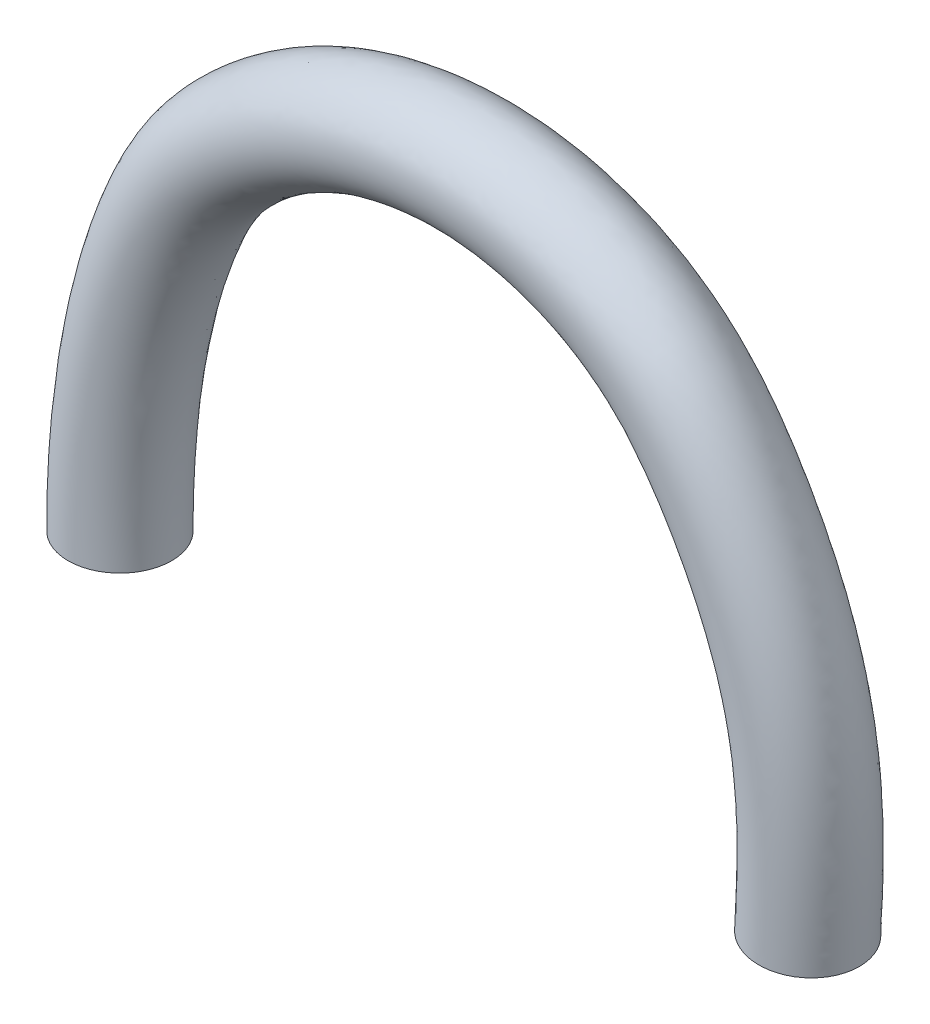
ISO-10303-21;
HEADER;
FILE_DESCRIPTION(('STEP AP214'),'2;1');
FILE_NAME('part.step','',(''),(''),'','','');
FILE_SCHEMA(('AUTOMOTIVE_DESIGN { 1 0 10303 214 1 1 1 1 }'));
ENDSEC;
DATA;
#1=APPLICATION_CONTEXT('core data for automotive mechanical design processes');
#2=APPLICATION_PROTOCOL_DEFINITION('international standard','automotive_design',2000,#1);
#3=PRODUCT_CONTEXT('',#1,'mechanical');
#4=PRODUCT('Part','Part','',(#3));
#5=PRODUCT_RELATED_PRODUCT_CATEGORY('part','',(#4));
#6=PRODUCT_DEFINITION_FORMATION('','',#4);
#7=PRODUCT_DEFINITION_CONTEXT('part definition',#1,'design');
#8=PRODUCT_DEFINITION('design','',#6,#7);
#9=PRODUCT_DEFINITION_SHAPE('','',#8);
#10=(LENGTH_UNIT() NAMED_UNIT(*) SI_UNIT(.MILLI.,.METRE.));
#11=(NAMED_UNIT(*) PLANE_ANGLE_UNIT() SI_UNIT($,.RADIAN.));
#12=(NAMED_UNIT(*) SI_UNIT($,.STERADIAN.) SOLID_ANGLE_UNIT());
#13=UNCERTAINTY_MEASURE_WITH_UNIT(LENGTH_MEASURE(1.E-05),#10,'distance_accuracy_value','');
#14=(GEOMETRIC_REPRESENTATION_CONTEXT(3) GLOBAL_UNCERTAINTY_ASSIGNED_CONTEXT((#13)) GLOBAL_UNIT_ASSIGNED_CONTEXT((#10,
#11,#12)) REPRESENTATION_CONTEXT('',''));
#15=CARTESIAN_POINT('',(0.,0.,0.));
#16=DIRECTION('',(0.,0.,1.));
#17=DIRECTION('',(1.,0.,0.));
#18=AXIS2_PLACEMENT_3D('',#15,#16,#17);
#19=CARTESIAN_POINT('',(0.,0.,0.));
#20=DIRECTION('',(0.,1.,0.));
#21=DIRECTION('',(0.,0.,1.));
#22=AXIS2_PLACEMENT_3D('',#19,#20,#21);
#23=PLANE('',#22);
#24=CARTESIAN_POINT('',(0.,0.,0.));
#25=DIRECTION('',(0.,-1.,0.));
#26=DIRECTION('',(0.,0.,-1.));
#27=AXIS2_PLACEMENT_3D('',#24,#25,#26);
#28=CIRCLE('',#27,19.1349262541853);
#29=CARTESIAN_POINT('',(0.,0.,-19.1349262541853));
#30=VERTEX_POINT('',#29);
#31=EDGE_CURVE('E17',#30,#30,#28,.F.);
#32=ORIENTED_EDGE('',*,*,#31,.F.);
#33=EDGE_LOOP('',(#32));
#34=FACE_BOUND('',#33,.T.);
#35=ADVANCED_FACE('F14',(#34),#23,.F.);
#36=CARTESIAN_POINT('',(0.,2.,0.));
#37=DIRECTION('',(0.,-1.,0.));
#38=DIRECTION('',(0.,0.,-1.));
#39=AXIS2_PLACEMENT_3D('',#36,#37,#38);
#40=CYLINDRICAL_SURFACE('',#39,19.1349262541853);
#41=CARTESIAN_POINT('',(0.,2.,0.));
#42=DIRECTION('',(0.,-1.,0.));
#43=DIRECTION('',(0.,0.,-1.));
#44=AXIS2_PLACEMENT_3D('',#41,#42,#43);
#45=CIRCLE('',#44,19.1349262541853);
#46=CARTESIAN_POINT('',(0.,2.,-19.1349262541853));
#47=VERTEX_POINT('',#46);
#48=EDGE_CURVE('E26',#47,#47,#45,.F.);
#49=ORIENTED_EDGE('',*,*,#48,.F.);
#50=EDGE_LOOP('',(#49));
#51=FACE_BOUND('',#50,.T.);
#52=ORIENTED_EDGE('',*,*,#31,.T.);
#53=EDGE_LOOP('',(#52));
#54=FACE_BOUND('',#53,.T.);
#55=ADVANCED_FACE('F46',(#51,#54),#40,.T.);
#56=CARTESIAN_POINT('',(0.,2.,0.));
#57=DIRECTION('',(0.,-1.,0.));
#58=DIRECTION('',(0.,0.,-1.));
#59=AXIS2_PLACEMENT_3D('',#56,#57,#58);
#60=PLANE('',#59);
#61=ORIENTED_EDGE('',*,*,#48,.T.);
#62=EDGE_LOOP('',(#61));
#63=FACE_BOUND('',#62,.T.);
#64=CARTESIAN_POINT('',(-0.0121576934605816,2.,-22.5));
#65=CARTESIAN_POINT('',(-0.643815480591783,2.,-22.4999946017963));
#66=CARTESIAN_POINT('',(-1.27563881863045,2.,-22.4733677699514));
#67=CARTESIAN_POINT('',(-2.21990731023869,2.,-22.3936498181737));
#68=CARTESIAN_POINT('',(-2.53417886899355,2.,-22.3604317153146));
#69=CARTESIAN_POINT('',(-3.16112636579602,2.,-22.2807833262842));
#70=CARTESIAN_POINT('',(-3.47380190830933,2.,-22.2343499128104));
#71=CARTESIAN_POINT('',(-4.40954743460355,2.,-22.0751587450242));
#72=CARTESIAN_POINT('',(-5.02935351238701,2.,-21.9425930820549));
#73=CARTESIAN_POINT('',(-6.25557790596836,2.,-21.6256464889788));
#74=CARTESIAN_POINT('',(-6.86199613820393,2.,-21.4412652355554));
#75=CARTESIAN_POINT('',(-7.7579981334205,2.,-21.1269692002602));
#76=CARTESIAN_POINT('',(-8.05432184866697,2.,-21.0159491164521));
#77=CARTESIAN_POINT('',(-8.64194809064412,2.,-20.7815462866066));
#78=CARTESIAN_POINT('',(-8.93325189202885,2.,-20.6581667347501));
#79=CARTESIAN_POINT('',(-9.79903577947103,2.,-20.2697260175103));
#80=CARTESIAN_POINT('',(-10.3654261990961,2.,-19.9863495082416));
#81=CARTESIAN_POINT('',(-11.47197093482,2.,-19.3730637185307));
#82=CARTESIAN_POINT('',(-12.0121378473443,2.,-19.0431770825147));
#83=CARTESIAN_POINT('',(-13.0627852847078,2.,-18.3390755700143));
#84=CARTESIAN_POINT('',(-13.5732660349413,2.,-17.9648610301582));
#85=CARTESIAN_POINT('',(-14.5609961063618,2.,-17.1746883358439));
#86=CARTESIAN_POINT('',(-15.0382384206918,2.,-16.7587214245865));
#87=CARTESIAN_POINT('',(-15.9559893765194,2.,-15.888063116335));
#88=CARTESIAN_POINT('',(-16.3964979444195,2.,-15.4333716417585));
#89=CARTESIAN_POINT('',(-17.2376834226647,2.,-14.4884575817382));
#90=CARTESIAN_POINT('',(-17.6383569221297,2.,-13.9982319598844));
#91=CARTESIAN_POINT('',(-18.3969814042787,2.,-12.9857695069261));
#92=CARTESIAN_POINT('',(-18.7549324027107,2.,-12.4635326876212));
#93=CARTESIAN_POINT('',(-19.4255632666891,2.,-11.3907672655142));
#94=CARTESIAN_POINT('',(-19.7382436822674,2.,-10.8402390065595));
#95=CARTESIAN_POINT('',(-20.3161159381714,2.,-9.7147988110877));
#96=CARTESIAN_POINT('',(-20.5813077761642,2.,-9.13988687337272));
#97=CARTESIAN_POINT('',(-21.0623152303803,2.,-7.96977281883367));
#98=CARTESIAN_POINT('',(-21.2781313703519,2.,-7.37457091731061));
#99=CARTESIAN_POINT('',(-21.6588570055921,2.,-6.16810249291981));
#100=CARTESIAN_POINT('',(-21.8237665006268,2.,-5.55683596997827));
#101=CARTESIAN_POINT('',(-22.1015105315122,2.,-4.32256664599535));
#102=CARTESIAN_POINT('',(-22.2143436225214,2.,-3.6995635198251));
#103=CARTESIAN_POINT('',(-22.3871260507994,2.,-2.44626658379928));
#104=CARTESIAN_POINT('',(-22.4470753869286,2.,-1.81597277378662));
#105=CARTESIAN_POINT('',(-22.5136641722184,2.,-0.552575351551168));
#106=CARTESIAN_POINT('',(-22.5203036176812,2.,0.0805282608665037));
#107=CARTESIAN_POINT('',(-22.4802254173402,2.,1.34504435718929));
#108=CARTESIAN_POINT('',(-22.4335077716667,2.,1.97645684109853));
#109=CARTESIAN_POINT('',(-22.2870470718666,2.,3.2331052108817));
#110=CARTESIAN_POINT('',(-22.1873037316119,2.,3.8583410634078));
#111=CARTESIAN_POINT('',(-21.9355004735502,2.,5.0981876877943));
#112=CARTESIAN_POINT('',(-21.783440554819,2.,5.71279845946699));
#113=CARTESIAN_POINT('',(-21.4280831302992,2.,6.92703189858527));
#114=CARTESIAN_POINT('',(-21.2247850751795,2.,7.52665440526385));
#115=CARTESIAN_POINT('',(-20.7683973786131,2.,8.70664131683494));
#116=CARTESIAN_POINT('',(-20.5153077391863,2.,9.28700572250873));
#117=CARTESIAN_POINT('',(-19.9611269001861,2.,10.4243688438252));
#118=CARTESIAN_POINT('',(-19.660034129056,2.,10.9813667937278));
#119=CARTESIAN_POINT('',(-19.0119935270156,2.,12.0680165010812));
#120=CARTESIAN_POINT('',(-18.6650456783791,2.,12.5976682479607));
#121=CARTESIAN_POINT('',(-17.9277927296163,2.,13.6258154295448));
#122=CARTESIAN_POINT('',(-17.537491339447,2.,14.124313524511));
#123=CARTESIAN_POINT('',(-16.7162841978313,2.,15.0866567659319));
#124=CARTESIAN_POINT('',(-16.2853785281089,2.,15.5505019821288));
#125=CARTESIAN_POINT('',(-15.3861155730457,2.,16.4401503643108));
#126=CARTESIAN_POINT('',(-14.9177663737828,2.,16.865961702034));
#127=CARTESIAN_POINT('',(-13.9468848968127,2.,17.6766183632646));
#128=CARTESIAN_POINT('',(-13.444352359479,2.,18.0614633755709));
#129=CARTESIAN_POINT('',(-12.4083334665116,2.,18.7876738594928));
#130=CARTESIAN_POINT('',(-11.8748322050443,2.,19.1290181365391));
#131=CARTESIAN_POINT('',(-11.0546213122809,2.,19.6063123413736));
#132=CARTESIAN_POINT('',(-10.7778821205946,2.,19.7596276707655));
#133=CARTESIAN_POINT('',(-10.2181138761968,2.,20.0544967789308));
#134=CARTESIAN_POINT('',(-9.93508322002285,2.,20.196047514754));
#135=CARTESIAN_POINT('',(-9.07704172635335,2.,20.6027694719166));
#136=CARTESIAN_POINT('',(-8.49334258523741,2.,20.8498584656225));
#137=CARTESIAN_POINT('',(-7.3071849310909,2.,21.2939122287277));
#138=CARTESIAN_POINT('',(-6.70472653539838,2.,21.4908773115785));
#139=CARTESIAN_POINT('',(-5.79086843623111,2.,21.7475198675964));
#140=CARTESIAN_POINT('',(-5.48479617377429,2.,21.8265534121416));
#141=CARTESIAN_POINT('',(-4.86967498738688,2.,21.9716424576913));
#142=CARTESIAN_POINT('',(-4.56062678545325,2.,22.0377010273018));
#143=CARTESIAN_POINT('',(-3.62994141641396,2.,22.2162026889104));
#144=CARTESIAN_POINT('',(-3.00439958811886,2.,22.3090738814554));
#145=CARTESIAN_POINT('',(-1.98362792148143,2.,22.4169378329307));
#146=CARTESIAN_POINT('',(-1.59000246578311,2.,22.44807514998));
#147=CARTESIAN_POINT('',(-0.801658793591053,2.,22.4896079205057));
#148=CARTESIAN_POINT('',(-0.406940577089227,2.,22.5000033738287));
#149=CARTESIAN_POINT('',(0.619497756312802,2.,22.4999946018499));
#150=CARTESIAN_POINT('',(1.25131875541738,2.,22.4733679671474));
#151=CARTESIAN_POINT('',(2.19558376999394,2.,22.3936505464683));
#152=CARTESIAN_POINT('',(2.50985417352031,2.,22.3604326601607));
#153=CARTESIAN_POINT('',(3.13679937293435,2.,22.2807847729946));
#154=CARTESIAN_POINT('',(3.44947377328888,2.,22.2343516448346));
#155=CARTESIAN_POINT('',(4.38521587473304,2.,22.0751614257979));
#156=CARTESIAN_POINT('',(5.00501969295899,2.,21.9425965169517));
#157=CARTESIAN_POINT('',(6.23123963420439,2.,21.6256516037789));
#158=CARTESIAN_POINT('',(6.83765567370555,2.,21.4412712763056));
#159=CARTESIAN_POINT('',(7.73365447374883,2.,21.1269767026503));
#160=CARTESIAN_POINT('',(8.02997716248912,2.,21.0159571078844));
#161=CARTESIAN_POINT('',(8.61760136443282,2.,20.7815552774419));
#162=CARTESIAN_POINT('',(8.90890415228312,2.,20.6581762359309));
#163=CARTESIAN_POINT('',(9.77468501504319,2.,20.2697370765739));
#164=CARTESIAN_POINT('',(10.341073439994,2.,19.9863616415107));
#165=CARTESIAN_POINT('',(11.4476142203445,2.,19.3730780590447));
#166=CARTESIAN_POINT('',(11.9877791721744,2.,19.0431925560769));
#167=CARTESIAN_POINT('',(13.0384227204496,2.,18.3390933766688));
#168=CARTESIAN_POINT('',(13.5489015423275,2.,17.9648800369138));
#169=CARTESIAN_POINT('',(14.5366267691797,2.,17.174710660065));
#170=CARTESIAN_POINT('',(15.0138662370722,2.,16.7587459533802));
#171=CARTESIAN_POINT('',(15.9316117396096,2.,15.8880923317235));
#172=CARTESIAN_POINT('',(16.372117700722,2.,15.4334033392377));
#173=CARTESIAN_POINT('',(17.2132982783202,2.,14.4884945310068));
#174=CARTESIAN_POINT('',(17.6139694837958,2.,13.9982716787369));
#175=CARTESIAN_POINT('',(18.3725897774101,2.,12.9858150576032));
#176=CARTESIAN_POINT('',(18.7305388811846,2.,12.4635813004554));
#177=CARTESIAN_POINT('',(19.4011671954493,2.,11.3908210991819));
#178=CARTESIAN_POINT('',(19.713846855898,2.,10.8402949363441));
#179=CARTESIAN_POINT('',(20.2917179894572,2.,9.71485908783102));
#180=CARTESIAN_POINT('',(20.5569094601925,2.,9.13994940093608));
#181=CARTESIAN_POINT('',(21.0379166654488,2.,7.96983996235));
#182=CARTESIAN_POINT('',(21.2537329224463,2.,7.37464042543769));
#183=CARTESIAN_POINT('',(21.6344593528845,2.,6.1681768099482));
#184=CARTESIAN_POINT('',(21.7993695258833,2.,5.55691273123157));
#185=CARTESIAN_POINT('',(22.0771162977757,2.,4.32264494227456));
#186=CARTESIAN_POINT('',(22.1899511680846,2.,3.69964084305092));
#187=CARTESIAN_POINT('',(22.3627372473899,2.,2.44634183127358));
#188=CARTESIAN_POINT('',(22.4226884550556,2.,1.8160469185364));
#189=CARTESIAN_POINT('',(22.4892810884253,2.,0.552647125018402));
#190=CARTESIAN_POINT('',(22.4959225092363,2.,-0.0804577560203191));
#191=CARTESIAN_POINT('',(22.4558483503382,2.,-1.34497656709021));
#192=CARTESIAN_POINT('',(22.4091327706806,2.,-1.97639049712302));
#193=CARTESIAN_POINT('',(22.2626759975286,2.,-3.23304419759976));
#194=CARTESIAN_POINT('',(22.1629343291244,2.,-3.85828391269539));
#195=CARTESIAN_POINT('',(21.9111340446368,2.,-5.09813838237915));
#196=CARTESIAN_POINT('',(21.7590754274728,2.,-5.7127531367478));
#197=CARTESIAN_POINT('',(21.403720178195,2.,-6.92699460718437));
#198=CARTESIAN_POINT('',(21.2004229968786,2.,-7.52662116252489));
#199=CARTESIAN_POINT('',(20.7440365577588,2.,-8.70661616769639));
#200=CARTESIAN_POINT('',(20.4909473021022,2.,-9.28698461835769));
#201=CARTESIAN_POINT('',(19.9367671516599,2.,-10.4243547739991));
#202=CARTESIAN_POINT('',(19.6356747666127,2.,-10.9813557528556));
#203=CARTESIAN_POINT('',(18.9876344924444,2.,-12.0680114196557));
#204=CARTESIAN_POINT('',(18.6406865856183,2.,-12.5976660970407));
#205=CARTESIAN_POINT('',(17.9034330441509,2.,-13.6258189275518));
#206=CARTESIAN_POINT('',(17.5131311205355,2.,-14.1243197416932));
#207=CARTESIAN_POINT('',(16.6919224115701,2.,-15.0866681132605));
#208=CARTESIAN_POINT('',(16.2610157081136,2.,-15.550515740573));
#209=CARTESIAN_POINT('',(15.3617525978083,2.,-16.4401661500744));
#210=CARTESIAN_POINT('',(14.8934044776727,2.,-16.8659773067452));
#211=CARTESIAN_POINT('',(13.9225250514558,2.,-17.6766335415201));
#212=CARTESIAN_POINT('',(13.4199934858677,2.,-18.0614783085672));
#213=CARTESIAN_POINT('',(12.3839764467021,2.,-18.7876881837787));
#214=CARTESIAN_POINT('',(11.8504760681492,2.,-19.1290320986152));
#215=CARTESIAN_POINT('',(11.0302664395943,2.,-19.6063256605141));
#216=CARTESIAN_POINT('',(10.7535276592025,2.,-19.759640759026));
#217=CARTESIAN_POINT('',(10.193760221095,2.,-20.0545093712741));
#218=CARTESIAN_POINT('',(9.91072995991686,2.,-20.1960598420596));
#219=CARTESIAN_POINT('',(9.05269190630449,2.,-20.6027798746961));
#220=CARTESIAN_POINT('',(8.468995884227,2.,-20.8498673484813));
#221=CARTESIAN_POINT('',(7.28284459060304,2.,-21.2939183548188));
#222=CARTESIAN_POINT('',(6.68038943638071,2.,-21.4908822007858));
#223=CARTESIAN_POINT('',(5.76653626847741,2.,-21.7475231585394));
#224=CARTESIAN_POINT('',(5.46046565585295,2.,-21.8265562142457));
#225=CARTESIAN_POINT('',(4.84534779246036,2.,-21.9716443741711));
#226=CARTESIAN_POINT('',(4.53630126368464,2.,-22.0377025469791));
#227=CARTESIAN_POINT('',(3.60562094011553,2.,-22.2162031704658));
#228=CARTESIAN_POINT('',(2.98008251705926,2.,-22.309073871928));
#229=CARTESIAN_POINT('',(1.95931398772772,2.,-22.4169376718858));
#230=CARTESIAN_POINT('',(1.56568824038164,2.,-22.4480750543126));
#231=CARTESIAN_POINT('',(0.777343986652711,2.,-22.4896079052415));
#232=CARTESIAN_POINT('',(0.382625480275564,2.,-22.5000033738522));
#233=CARTESIAN_POINT('',(-0.0121576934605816,2.,-22.5));
#234=B_SPLINE_CURVE_WITH_KNOTS('',3,(#64,#65,#66,#67,#68,#69,#70,#71,#72,#73,#74,#75,#76,#77,
#78,#79,#80,#81,#82,#83,#84,#85,#86,#87,#88,#89,#90,#91,#92,#93,#94,#95,#96,#97,#98,#99,#100,
#101,#102,#103,#104,#105,#106,#107,#108,#109,#110,#111,#112,#113,#114,#115,#116,#117,#118,#119,
#120,#121,#122,#123,#124,#125,#126,#127,#128,#129,#130,#131,#132,#133,#134,#135,#136,#137,#138,
#139,#140,#141,#142,#143,#144,#145,#146,#147,#148,#149,#150,#151,#152,#153,#154,#155,#156,#157,
#158,#159,#160,#161,#162,#163,#164,#165,#166,#167,#168,#169,#170,#171,#172,#173,#174,#175,#176,
#177,#178,#179,#180,#181,#182,#183,#184,#185,#186,#187,#188,#189,#190,#191,#192,#193,#194,#195,
#196,#197,#198,#199,#200,#201,#202,#203,#204,#205,#206,#207,#208,#209,#210,#211,#212,#213,#214,
#215,#216,#217,#218,#219,#220,#221,#222,#223,#224,#225,#226,#227,#228,#229,#230,#231,#232,#233),
.UNSPECIFIED.,.T.,.F.,(4,2,2,2,2,2,2,2,2,2,2,2,2,2,2,2,2,2,2,2,2,2,2,2,2,2,2,2,2,2,2,2,2,2,2,2,
2,2,2,2,2,2,2,2,2,2,2,2,2,2,2,2,2,2,2,2,2,2,2,2,2,2,2,2,2,2,2,2,2,2,2,2,2,2,2,2,2,2,2,2,2,2,2,2,
4),(0.,1.89454826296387,2.84238754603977,3.79045131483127,5.68952812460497,7.58861678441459,
8.53768443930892,9.48650744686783,11.3840335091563,13.2806388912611,15.1772298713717,
17.0742194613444,18.9712128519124,20.8683685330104,22.7655235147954,24.6626554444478,
26.5597874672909,28.4568993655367,30.3540112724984,32.251175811,34.1483403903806,
36.0455051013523,37.9426698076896,39.8398447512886,41.7370197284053,43.6342150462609,
45.5314102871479,47.4286676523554,49.3259257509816,51.2230216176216,53.1201136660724,
55.0167971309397,56.9134950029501,58.8111134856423,59.7599826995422,60.7090965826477,
62.6082280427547,64.5073476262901,65.4554326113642,66.4032931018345,68.2978836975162,
69.4819666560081,70.6660496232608,72.5605908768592,73.5084266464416,74.4564869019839,
76.3555566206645,78.2546381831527,79.2037024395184,80.1525220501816,82.0500413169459,
83.9466399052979,85.8432240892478,87.7402029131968,89.6371855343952,91.5343304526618,
93.4314746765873,95.3286000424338,97.225725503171,99.1228308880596,101.019936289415,
102.917104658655,104.814273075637,106.711441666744,108.608610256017,110.505795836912,
112.402981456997,114.300187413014,116.197393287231,118.094658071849,119.991923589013,
121.889026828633,123.78612624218,125.682806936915,127.579502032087,129.477117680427,
130.425985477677,131.375097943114,133.274219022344,135.173328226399,136.121408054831,
137.069263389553,138.963843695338,140.147927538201,141.332011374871),.UNSPECIFIED.);
#235=CARTESIAN_POINT('',(-0.0121576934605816,2.,-22.5));
#236=VERTEX_POINT('',#235);
#237=EDGE_CURVE('E21',#236,#236,#234,.T.);
#238=ORIENTED_EDGE('',*,*,#237,.F.);
#239=EDGE_LOOP('',(#238));
#240=FACE_BOUND('',#239,.T.);
#241=ADVANCED_FACE('F42',(#63,#240),#60,.T.);
#242=CARTESIAN_POINT('',(299.,0.,0.));
#243=DIRECTION('',(-0.0562123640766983,-0.998418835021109,0.));
#244=DIRECTION('',(0.998418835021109,-0.0562123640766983,0.));
#245=AXIS2_PLACEMENT_3D('',#242,#243,#244);
#246=PLANE('',#245);
#247=CARTESIAN_POINT('',(299.,0.,22.5));
#248=CARTESIAN_POINT('',(299.630688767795,-0.0355086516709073,22.4999946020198));
#249=CARTESIAN_POINT('',(300.261542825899,-0.0710266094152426,22.4733667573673));
#250=CARTESIAN_POINT('',(301.204362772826,-0.124108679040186,22.393645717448));
#251=CARTESIAN_POINT('',(301.518152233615,-0.141775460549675,22.3604263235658));
#252=CARTESIAN_POINT('',(302.144138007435,-0.177019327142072,22.2807748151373));
#253=CARTESIAN_POINT('',(302.456333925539,-0.194596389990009,22.2343395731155));
#254=CARTESIAN_POINT('',(303.39064411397,-0.247199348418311,22.0751420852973));
#255=CARTESIAN_POINT('',(304.009499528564,-0.28204176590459,21.9425710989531));
#256=CARTESIAN_POINT('',(305.233843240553,-0.350974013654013,21.6256114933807));
#257=CARTESIAN_POINT('',(305.839331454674,-0.385063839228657,21.441222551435));
#258=CARTESIAN_POINT('',(306.733959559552,-0.435432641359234,21.1269130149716));
#259=CARTESIAN_POINT('',(307.029829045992,-0.452090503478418,21.0158880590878));
#260=CARTESIAN_POINT('',(307.616554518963,-0.485123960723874,20.7814748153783));
#261=CARTESIAN_POINT('',(307.907411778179,-0.501499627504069,20.6580897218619));
#262=CARTESIAN_POINT('',(308.771868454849,-0.550169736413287,20.2696313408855));
#263=CARTESIAN_POINT('',(309.337390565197,-0.582009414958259,19.9862416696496));
#264=CARTESIAN_POINT('',(310.442238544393,-0.644213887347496,19.37292666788));
#265=CARTESIAN_POINT('',(310.981576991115,-0.67457938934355,19.0430239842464));
#266=CARTESIAN_POINT('',(312.030612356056,-0.733641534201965,18.3388873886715));
#267=CARTESIAN_POINT('',(312.540309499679,-0.762338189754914,17.9646538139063));
#268=CARTESIAN_POINT('',(313.526515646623,-0.817862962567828,17.1744453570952));
#269=CARTESIAN_POINT('',(314.0030181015,-0.844690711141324,16.7584622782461));
#270=CARTESIAN_POINT('',(314.919345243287,-0.896281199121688,15.8877696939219));
#271=CARTESIAN_POINT('',(315.359169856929,-0.921043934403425,15.4330601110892));
#272=CARTESIAN_POINT('',(316.199047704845,-0.968330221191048,14.4881079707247));
#273=CARTESIAN_POINT('',(316.599097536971,-0.990853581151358,13.9978623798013));
#274=CARTESIAN_POINT('',(317.356539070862,-1.0334985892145,12.9853582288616));
#275=CARTESIAN_POINT('',(317.713930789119,-1.05362023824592,12.4630996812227));
#276=CARTESIAN_POINT('',(318.383502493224,-1.09131805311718,11.3903029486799));
#277=CARTESIAN_POINT('',(318.695684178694,-1.1088943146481,10.8397658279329));
#278=CARTESIAN_POINT('',(319.272632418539,-1.14137730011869,9.71430788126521));
#279=CARTESIAN_POINT('',(319.537398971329,-1.1562840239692,9.1393870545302));
#280=CARTESIAN_POINT('',(320.017631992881,-1.18332180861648,7.96925538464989));
#281=CARTESIAN_POINT('',(320.233098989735,-1.1954528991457,7.37404475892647));
#282=CARTESIAN_POINT('',(320.613204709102,-1.21685337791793,6.167559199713));
#283=CARTESIAN_POINT('',(320.777843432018,-1.22612276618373,5.5562842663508));
#284=CARTESIAN_POINT('',(321.055122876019,-1.24173398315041,4.32201253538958));
#285=CARTESIAN_POINT('',(321.167763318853,-1.24807579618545,3.69901567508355));
#286=CARTESIAN_POINT('',(321.340244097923,-1.25778670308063,2.44573240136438));
#287=CARTESIAN_POINT('',(321.400084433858,-1.2611557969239,1.81544598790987));
#288=CARTESIAN_POINT('',(321.466539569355,-1.26489731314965,0.552064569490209));
#289=CARTESIAN_POINT('',(321.473154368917,-1.26526973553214,-0.0810304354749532));
#290=CARTESIAN_POINT('',(321.433111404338,-1.26301526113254,-1.34552810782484));
#291=CARTESIAN_POINT('',(321.386453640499,-1.26038836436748,-1.97693077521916));
#292=CARTESIAN_POINT('',(321.240197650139,-1.25215394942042,-3.23355151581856));
#293=CARTESIAN_POINT('',(321.140599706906,-1.24654644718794,-3.85876962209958));
#294=CARTESIAN_POINT('',(320.889171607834,-1.23239069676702,-5.09857979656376));
#295=CARTESIAN_POINT('',(320.737341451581,-1.22384244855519,-5.71317186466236));
#296=CARTESIAN_POINT('',(320.382526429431,-1.20386587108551,-6.92736713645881));
#297=CARTESIAN_POINT('',(320.179541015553,-1.19243751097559,-7.52697017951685));
#298=CARTESIAN_POINT('',(319.723859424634,-1.16678200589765,-8.70691767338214));
#299=CARTESIAN_POINT('',(319.471163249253,-1.15255486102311,-9.28726212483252));
#300=CARTESIAN_POINT('',(318.917846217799,-1.12140234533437,-10.4245879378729));
#301=CARTESIAN_POINT('',(318.617223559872,-1.10447687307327,-10.9815684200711));
#302=CARTESIAN_POINT('',(317.970197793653,-1.06804842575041,-12.0681831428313));
#303=CARTESIAN_POINT('',(317.62379466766,-1.04854544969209,-12.5978173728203));
#304=CARTESIAN_POINT('',(316.887702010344,-1.00710241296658,-13.6259299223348));
#305=CARTESIAN_POINT('',(316.498016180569,-0.985162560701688,-14.1244109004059));
#306=CARTESIAN_POINT('',(315.67810681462,-0.93900052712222,-15.0867207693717));
#307=CARTESIAN_POINT('',(315.247883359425,-0.914778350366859,-15.5505497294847));
#308=CARTESIAN_POINT('',(314.350038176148,-0.864228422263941,-16.4401753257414));
#309=CARTESIAN_POINT('',(313.882423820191,-0.837901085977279,-16.8659794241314));
#310=CARTESIAN_POINT('',(312.913067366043,-0.783324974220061,-17.6766220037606));
#311=CARTESIAN_POINT('',(312.411325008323,-0.755076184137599,-18.0614601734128));
#312=CARTESIAN_POINT('',(311.376936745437,-0.696838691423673,-18.7876578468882));
#313=CARTESIAN_POINT('',(310.844275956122,-0.666849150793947,-19.1289961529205));
#314=CARTESIAN_POINT('',(310.025358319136,-0.620742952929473,-19.6062823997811));
#315=CARTESIAN_POINT('',(309.749055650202,-0.60518672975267,-19.7595952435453));
#316=CARTESIAN_POINT('',(309.190170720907,-0.57372073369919,-20.0544597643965));
#317=CARTESIAN_POINT('',(308.90758685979,-0.557810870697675,-20.1960083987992));
#318=CARTESIAN_POINT('',(308.050885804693,-0.509577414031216,-20.6027316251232));
#319=CARTESIAN_POINT('',(307.468093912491,-0.476765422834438,-20.8498234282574));
#320=CARTESIAN_POINT('',(306.283780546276,-0.410086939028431,-21.2938824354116));
#321=CARTESIAN_POINT('',(305.682259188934,-0.376220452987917,-21.4908499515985));
#322=CARTESIAN_POINT('',(304.769822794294,-0.324849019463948,-21.7474960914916));
#323=CARTESIAN_POINT('',(304.464226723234,-0.30764353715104,-21.8265308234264));
#324=CARTESIAN_POINT('',(303.850062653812,-0.273065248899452,-21.9716222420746));
#325=CARTESIAN_POINT('',(303.541495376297,-0.255692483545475,-22.0376819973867));
#326=CARTESIAN_POINT('',(302.612258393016,-0.20337515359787,-22.2161872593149));
#327=CARTESIAN_POINT('',(301.987690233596,-0.168211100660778,-22.3090609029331));
#328=CARTESIAN_POINT('',(300.968489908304,-0.110828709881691,-22.4169309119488));
#329=CARTESIAN_POINT('',(300.575459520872,-0.0887005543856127,-22.4480708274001));
#330=CARTESIAN_POINT('',(299.788307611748,-0.0443828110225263,-22.4896070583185));
#331=CARTESIAN_POINT('',(299.394186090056,-0.0221932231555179,-22.5000033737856));
#332=CARTESIAN_POINT('',(298.369311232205,0.0355086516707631,-22.4999946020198));
#333=CARTESIAN_POINT('',(297.738457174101,0.0710266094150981,-22.4733667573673));
#334=CARTESIAN_POINT('',(296.795637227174,0.124108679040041,-22.393645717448));
#335=CARTESIAN_POINT('',(296.481847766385,0.14177546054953,-22.3604263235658));
#336=CARTESIAN_POINT('',(295.855861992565,0.177019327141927,-22.2807748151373));
#337=CARTESIAN_POINT('',(295.543666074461,0.194596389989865,-22.2343395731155));
#338=CARTESIAN_POINT('',(294.60935588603,0.247199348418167,-22.0751420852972));
#339=CARTESIAN_POINT('',(293.990500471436,0.282041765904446,-21.9425710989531));
#340=CARTESIAN_POINT('',(292.766156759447,0.350974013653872,-21.6256114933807));
#341=CARTESIAN_POINT('',(292.160668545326,0.385063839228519,-21.441222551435));
#342=CARTESIAN_POINT('',(291.266040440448,0.435432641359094,-21.1269130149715));
#343=CARTESIAN_POINT('',(290.970170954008,0.452090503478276,-21.0158880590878));
#344=CARTESIAN_POINT('',(290.383445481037,0.485123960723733,-20.7814748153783));
#345=CARTESIAN_POINT('',(290.092588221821,0.501499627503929,-20.6580897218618));
#346=CARTESIAN_POINT('',(289.228131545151,0.550169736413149,-20.2696313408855));
#347=CARTESIAN_POINT('',(288.662609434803,0.58200941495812,-19.9862416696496));
#348=CARTESIAN_POINT('',(287.557761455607,0.644213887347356,-19.37292666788));
#349=CARTESIAN_POINT('',(287.018423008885,0.67457938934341,-19.0430239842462));
#350=CARTESIAN_POINT('',(285.969387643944,0.733641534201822,-18.3388873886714));
#351=CARTESIAN_POINT('',(285.459690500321,0.762338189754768,-17.9646538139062));
#352=CARTESIAN_POINT('',(284.473484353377,0.817862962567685,-17.1744453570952));
#353=CARTESIAN_POINT('',(283.9969818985,0.844690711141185,-16.758462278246));
#354=CARTESIAN_POINT('',(283.080654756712,0.896281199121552,-15.8877696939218));
#355=CARTESIAN_POINT('',(282.640830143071,0.921043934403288,-15.4330601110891));
#356=CARTESIAN_POINT('',(281.800952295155,0.968330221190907,-14.4881079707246));
#357=CARTESIAN_POINT('',(281.400902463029,0.990853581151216,-13.9978623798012));
#358=CARTESIAN_POINT('',(280.643460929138,1.03349858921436,-12.9853582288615));
#359=CARTESIAN_POINT('',(280.286069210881,1.05362023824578,-12.4630996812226));
#360=CARTESIAN_POINT('',(279.616497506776,1.09131805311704,-11.3903029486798));
#361=CARTESIAN_POINT('',(279.304315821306,1.10889431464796,-10.8397658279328));
#362=CARTESIAN_POINT('',(278.727367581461,1.14137730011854,-9.71430788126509));
#363=CARTESIAN_POINT('',(278.46260102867,1.15628402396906,-9.1393870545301));
#364=CARTESIAN_POINT('',(277.982368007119,1.18332180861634,-7.96925538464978));
#365=CARTESIAN_POINT('',(277.766901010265,1.19545289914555,-7.37404475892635));
#366=CARTESIAN_POINT('',(277.386795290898,1.21685337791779,-6.16755919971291));
#367=CARTESIAN_POINT('',(277.222156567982,1.22612276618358,-5.55628426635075));
#368=CARTESIAN_POINT('',(276.944877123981,1.24173398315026,-4.32201253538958));
#369=CARTESIAN_POINT('',(276.832236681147,1.24807579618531,-3.69901567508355));
#370=CARTESIAN_POINT('',(276.659755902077,1.25778670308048,-2.44573240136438));
#371=CARTESIAN_POINT('',(276.599915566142,1.26115579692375,-1.8154459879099));
#372=CARTESIAN_POINT('',(276.533460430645,1.26489731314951,-0.552064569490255));
#373=CARTESIAN_POINT('',(276.526845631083,1.265269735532,0.0810304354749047));
#374=CARTESIAN_POINT('',(276.566888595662,1.2630152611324,1.34552810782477));
#375=CARTESIAN_POINT('',(276.613546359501,1.26038836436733,1.97693077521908));
#376=CARTESIAN_POINT('',(276.759802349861,1.25215394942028,3.23355151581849));
#377=CARTESIAN_POINT('',(276.859400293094,1.2465464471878,3.85876962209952));
#378=CARTESIAN_POINT('',(277.110828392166,1.23239069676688,5.09857979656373));
#379=CARTESIAN_POINT('',(277.262658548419,1.22384244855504,5.71317186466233));
#380=CARTESIAN_POINT('',(277.617473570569,1.20386587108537,6.9273671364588));
#381=CARTESIAN_POINT('',(277.820458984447,1.19243751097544,7.52697017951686));
#382=CARTESIAN_POINT('',(278.276140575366,1.16678200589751,8.70691767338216));
#383=CARTESIAN_POINT('',(278.528836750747,1.15255486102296,9.28726212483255));
#384=CARTESIAN_POINT('',(279.082153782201,1.12140234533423,10.4245879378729));
#385=CARTESIAN_POINT('',(279.382776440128,1.10447687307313,10.9815684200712));
#386=CARTESIAN_POINT('',(280.029802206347,1.06804842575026,12.0681831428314));
#387=CARTESIAN_POINT('',(280.37620533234,1.04854544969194,12.5978173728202));
#388=CARTESIAN_POINT('',(281.112297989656,1.00710241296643,13.6259299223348));
#389=CARTESIAN_POINT('',(281.501983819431,0.985162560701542,14.124410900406));
#390=CARTESIAN_POINT('',(282.32189318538,0.939000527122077,15.0867207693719));
#391=CARTESIAN_POINT('',(282.752116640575,0.914778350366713,15.5505497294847));
#392=CARTESIAN_POINT('',(283.649961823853,0.86422842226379,16.4401753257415));
#393=CARTESIAN_POINT('',(284.117576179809,0.837901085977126,16.8659794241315));
#394=CARTESIAN_POINT('',(285.086932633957,0.783324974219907,17.6766220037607));
#395=CARTESIAN_POINT('',(285.588674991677,0.755076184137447,18.0614601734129));
#396=CARTESIAN_POINT('',(286.623063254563,0.696838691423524,18.7876578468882));
#397=CARTESIAN_POINT('',(287.155724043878,0.666849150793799,19.1289961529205));
#398=CARTESIAN_POINT('',(287.974641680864,0.620742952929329,19.6062823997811));
#399=CARTESIAN_POINT('',(288.250944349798,0.605186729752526,19.7595952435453));
#400=CARTESIAN_POINT('',(288.809829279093,0.573720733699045,20.0544597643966));
#401=CARTESIAN_POINT('',(289.09241314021,0.557810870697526,20.1960083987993));
#402=CARTESIAN_POINT('',(289.949114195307,0.509577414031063,20.6027316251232));
#403=CARTESIAN_POINT('',(290.531906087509,0.476765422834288,20.8498234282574));
#404=CARTESIAN_POINT('',(291.716219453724,0.410086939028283,21.2938824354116));
#405=CARTESIAN_POINT('',(292.317740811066,0.37622045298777,21.4908499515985));
#406=CARTESIAN_POINT('',(293.230177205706,0.324849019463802,21.7474960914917));
#407=CARTESIAN_POINT('',(293.535773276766,0.307643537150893,21.8265308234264));
#408=CARTESIAN_POINT('',(294.149937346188,0.273065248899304,21.9716222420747));
#409=CARTESIAN_POINT('',(294.458504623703,0.255692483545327,22.0376819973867));
#410=CARTESIAN_POINT('',(295.387741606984,0.203375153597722,22.2161872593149));
#411=CARTESIAN_POINT('',(296.012309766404,0.168211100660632,22.3090609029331));
#412=CARTESIAN_POINT('',(297.031510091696,0.110828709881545,22.4169309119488));
#413=CARTESIAN_POINT('',(297.424540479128,0.0887005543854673,22.4480708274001));
#414=CARTESIAN_POINT('',(298.211692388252,0.0443828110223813,22.4896070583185));
#415=CARTESIAN_POINT('',(298.605813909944,0.0221932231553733,22.5000033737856));
#416=CARTESIAN_POINT('',(299.,0.,22.5));
#417=B_SPLINE_CURVE_WITH_KNOTS('',3,(#247,#248,#249,#250,#251,#252,#253,#254,#255,#256,#257,
#258,#259,#260,#261,#262,#263,#264,#265,#266,#267,#268,#269,#270,#271,#272,#273,#274,#275,#276,
#277,#278,#279,#280,#281,#282,#283,#284,#285,#286,#287,#288,#289,#290,#291,#292,#293,#294,#295,
#296,#297,#298,#299,#300,#301,#302,#303,#304,#305,#306,#307,#308,#309,#310,#311,#312,#313,#314,
#315,#316,#317,#318,#319,#320,#321,#322,#323,#324,#325,#326,#327,#328,#329,#330,#331,#332,#333,
#334,#335,#336,#337,#338,#339,#340,#341,#342,#343,#344,#345,#346,#347,#348,#349,#350,#351,#352,
#353,#354,#355,#356,#357,#358,#359,#360,#361,#362,#363,#364,#365,#366,#367,#368,#369,#370,#371,
#372,#373,#374,#375,#376,#377,#378,#379,#380,#381,#382,#383,#384,#385,#386,#387,#388,#389,#390,
#391,#392,#393,#394,#395,#396,#397,#398,#399,#400,#401,#402,#403,#404,#405,#406,#407,#408,#409,
#410,#411,#412,#413,#414,#415,#416),.UNSPECIFIED.,.T.,.F.,(4,2,2,2,2,2,2,2,2,2,2,2,2,2,2,2,2,2,
2,2,2,2,2,2,2,2,2,2,2,2,2,2,2,2,2,2,2,2,2,2,2,2,2,2,2,2,2,2,2,2,2,2,2,2,2,2,2,2,2,2,2,2,2,2,2,2,
2,2,2,2,2,2,2,2,2,2,2,2,2,2,2,2,2,2,4),(0.,1.894637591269,2.84252154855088,3.79063000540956,
5.68979630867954,7.5889744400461,8.53808746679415,9.48695583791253,11.3845726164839,
13.2812686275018,15.1779502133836,17.0750049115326,18.9720633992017,20.8692840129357,
22.7665038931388,24.6636524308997,26.5608010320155,28.4579293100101,30.3550575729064,
32.252195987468,34.1493344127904,36.0464728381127,37.9436112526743,39.8407395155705,
41.7378677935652,43.6350163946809,45.5321649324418,47.4293848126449,49.326605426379,
51.2236639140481,53.120718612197,55.0174001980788,56.9140962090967,58.811712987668,
59.7605813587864,60.7096943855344,62.608872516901,64.5080388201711,65.4561472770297,
66.4040312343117,68.2986688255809,69.4828341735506,70.6669995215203,72.5616371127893,
73.5095210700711,74.4576295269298,76.3567958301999,78.2559739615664,79.2050869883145,
80.1539553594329,82.0515721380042,83.9482681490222,85.844949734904,87.742004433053,
89.6390629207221,91.5362835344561,93.4335034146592,95.3306519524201,97.2278005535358,
99.1249288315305,101.022057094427,102.919195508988,104.816333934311,106.713472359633,
108.610610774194,110.507739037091,112.404867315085,114.302015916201,116.199164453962,
118.096384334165,119.993604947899,121.890663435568,123.787718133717,125.684399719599,
127.581095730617,129.478712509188,130.427580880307,131.376693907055,133.275872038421,
135.175038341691,136.12314679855,137.071030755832,138.965668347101,140.149833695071,
141.333999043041),.UNSPECIFIED.);
#418=CARTESIAN_POINT('',(299.,0.,22.5));
#419=VERTEX_POINT('',#418);
#420=EDGE_CURVE('E10',#419,#419,#417,.T.);
#421=ORIENTED_EDGE('',*,*,#420,.F.);
#422=EDGE_LOOP('',(#421));
#423=FACE_BOUND('',#422,.T.);
#424=ADVANCED_FACE('F39',(#423),#246,.T.);
#425=CARTESIAN_POINT('',(0.,0.,22.5));
#426=CARTESIAN_POINT('',(-0.256974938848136,30.5600772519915,22.5));
#427=CARTESIAN_POINT('',(2.77427949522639,57.7247286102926,22.5));
#428=CARTESIAN_POINT('',(9.89529992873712,92.3700442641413,22.5));
#429=CARTESIAN_POINT('',(12.6979965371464,102.901539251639,22.5));
#430=CARTESIAN_POINT('',(18.7684018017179,121.762555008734,22.5));
#431=CARTESIAN_POINT('',(22.0361104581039,130.092075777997,22.5));
#432=CARTESIAN_POINT('',(27.2481923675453,141.36358803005,22.5));
#433=CARTESIAN_POINT('',(29.1685855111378,145.095188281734,22.5));
#434=CARTESIAN_POINT('',(33.0516521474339,151.922146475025,22.5));
#435=CARTESIAN_POINT('',(35.0143256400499,155.017504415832,22.5));
#436=CARTESIAN_POINT('',(40.993160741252,163.581116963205,22.5));
#437=CARTESIAN_POINT('',(45.1001369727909,168.326910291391,22.5));
#438=CARTESIAN_POINT('',(56.3488396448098,179.836630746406,22.5));
#439=CARTESIAN_POINT('',(63.8029704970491,186.045585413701,22.5));
#440=CARTESIAN_POINT('',(79.4431631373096,196.71093561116,22.5));
#441=CARTESIAN_POINT('',(87.6292249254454,201.167331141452,22.5));
#442=CARTESIAN_POINT('',(112.863578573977,211.97838528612,22.5));
#443=CARTESIAN_POINT('',(130.588038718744,215.774911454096,22.5));
#444=CARTESIAN_POINT('',(165.590857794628,216.923377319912,22.5));
#445=CARTESIAN_POINT('',(182.869216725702,214.275317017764,22.5));
#446=CARTESIAN_POINT('',(206.765266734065,205.752611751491,22.5));
#447=CARTESIAN_POINT('',(214.39370200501,202.15327419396,22.5));
#448=CARTESIAN_POINT('',(228.695591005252,193.484864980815,22.5));
#449=CARTESIAN_POINT('',(235.369044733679,188.415793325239,22.5));
#450=CARTESIAN_POINT('',(247.297437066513,177.029151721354,22.5));
#451=CARTESIAN_POINT('',(252.589045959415,170.753783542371,22.5));
#452=CARTESIAN_POINT('',(262.129157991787,157.719335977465,22.5));
#453=CARTESIAN_POINT('',(266.377661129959,150.960256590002,22.5));
#454=CARTESIAN_POINT('',(278.420150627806,130.055067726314,22.5));
#455=CARTESIAN_POINT('',(284.481361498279,116.604701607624,22.5));
#456=CARTESIAN_POINT('',(293.311765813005,91.0067641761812,22.5));
#457=CARTESIAN_POINT('',(296.080959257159,78.8591928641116,22.5));
#458=CARTESIAN_POINT('',(299.424280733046,55.4073825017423,22.5));
#459=CARTESIAN_POINT('',(299.998408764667,44.1031434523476,22.5));
#460=CARTESIAN_POINT('',(300.048551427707,21.878535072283,22.5));
#461=CARTESIAN_POINT('',(299.524566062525,10.958165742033,22.5));
#462=CARTESIAN_POINT('',(299.,0.,22.5));
#463=CARTESIAN_POINT('',(45.,0.,22.5));
#464=CARTESIAN_POINT('',(44.743025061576,27.3603661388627,22.5));
#465=CARTESIAN_POINT('',(47.4416105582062,51.404461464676,22.5));
#466=CARTESIAN_POINT('',(53.5628349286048,81.3848065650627,22.5));
#467=CARTESIAN_POINT('',(55.9483860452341,90.3609844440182,22.5));
#468=CARTESIAN_POINT('',(60.9551932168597,106.010211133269,22.5));
#469=CARTESIAN_POINT('',(63.5836987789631,112.688662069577,22.5));
#470=CARTESIAN_POINT('',(67.4338612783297,121.078772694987,22.5));
#471=CARTESIAN_POINT('',(68.7687784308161,123.679646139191,22.5));
#472=CARTESIAN_POINT('',(71.3053805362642,128.184981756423,22.5));
#473=CARTESIAN_POINT('',(72.505713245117,130.090390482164,22.5));
#474=CARTESIAN_POINT('',(76.048175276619,135.226107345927,22.5));
#475=CARTESIAN_POINT('',(78.3227434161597,137.918218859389,22.5));
#476=CARTESIAN_POINT('',(86.1569505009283,145.99248340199,22.5));
#477=CARTESIAN_POINT('',(91.2917554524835,150.295647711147,22.5));
#478=CARTESIAN_POINT('',(102.032801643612,157.680183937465,22.5));
#479=CARTESIAN_POINT('',(107.640891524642,160.760448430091,22.5));
#480=CARTESIAN_POINT('',(124.958802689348,168.258396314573,22.5));
#481=CARTESIAN_POINT('',(137.188869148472,170.922551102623,22.5));
#482=CARTESIAN_POINT('',(161.184932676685,171.802506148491,22.5));
#483=CARTESIAN_POINT('',(172.909783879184,170.000246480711,22.5));
#484=CARTESIAN_POINT('',(188.535854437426,164.505714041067,22.5));
#485=CARTESIAN_POINT('',(193.41990440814,162.216125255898,22.5));
#486=CARTESIAN_POINT('',(202.374355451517,156.850610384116,22.5));
#487=CARTESIAN_POINT('',(206.444686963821,153.778242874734,22.5));
#488=CARTESIAN_POINT('',(213.605386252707,147.020003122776,22.5));
#489=CARTESIAN_POINT('',(217.276548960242,142.782153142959,22.5));
#490=CARTESIAN_POINT('',(224.371730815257,133.147782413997,22.5));
#491=CARTESIAN_POINT('',(227.795305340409,127.767997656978,22.5));
#492=CARTESIAN_POINT('',(237.935527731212,110.23020493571,22.5));
#493=CARTESIAN_POINT('',(242.766666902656,99.4656322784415,22.5));
#494=CARTESIAN_POINT('',(249.702727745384,79.5126247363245,22.5));
#495=CARTESIAN_POINT('',(251.825027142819,70.3047051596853,22.5));
#496=CARTESIAN_POINT('',(254.477416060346,52.0094208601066,22.5));
#497=CARTESIAN_POINT('',(254.990147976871,42.8989136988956,22.5));
#498=CARTESIAN_POINT('',(255.058515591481,23.6364838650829,22.5));
#499=CARTESIAN_POINT('',(254.595907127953,13.4910726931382,22.5));
#500=CARTESIAN_POINT('',(254.07115242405,2.52955638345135,22.5));
#501=CARTESIAN_POINT('',(45.,0.,-22.5));
#502=CARTESIAN_POINT('',(44.743025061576,27.3603661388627,-22.5));
#503=CARTESIAN_POINT('',(47.4416105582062,51.404461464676,-22.5));
#504=CARTESIAN_POINT('',(53.5628349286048,81.3848065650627,-22.5));
#505=CARTESIAN_POINT('',(55.9483860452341,90.3609844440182,-22.5));
#506=CARTESIAN_POINT('',(60.9551932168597,106.010211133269,-22.5));
#507=CARTESIAN_POINT('',(63.5836987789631,112.688662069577,-22.5));
#508=CARTESIAN_POINT('',(67.4338612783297,121.078772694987,-22.5));
#509=CARTESIAN_POINT('',(68.7687784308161,123.679646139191,-22.5));
#510=CARTESIAN_POINT('',(71.3053805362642,128.184981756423,-22.5));
#511=CARTESIAN_POINT('',(72.505713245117,130.090390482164,-22.5));
#512=CARTESIAN_POINT('',(76.048175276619,135.226107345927,-22.5));
#513=CARTESIAN_POINT('',(78.3227434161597,137.918218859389,-22.5));
#514=CARTESIAN_POINT('',(86.1569505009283,145.99248340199,-22.5));
#515=CARTESIAN_POINT('',(91.2917554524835,150.295647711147,-22.5));
#516=CARTESIAN_POINT('',(102.032801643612,157.680183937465,-22.5));
#517=CARTESIAN_POINT('',(107.640891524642,160.760448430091,-22.5));
#518=CARTESIAN_POINT('',(124.958802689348,168.258396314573,-22.5));
#519=CARTESIAN_POINT('',(137.188869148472,170.922551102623,-22.5));
#520=CARTESIAN_POINT('',(161.184932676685,171.802506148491,-22.5));
#521=CARTESIAN_POINT('',(172.909783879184,170.000246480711,-22.5));
#522=CARTESIAN_POINT('',(188.535854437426,164.505714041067,-22.5));
#523=CARTESIAN_POINT('',(193.41990440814,162.216125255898,-22.5));
#524=CARTESIAN_POINT('',(202.374355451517,156.850610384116,-22.5));
#525=CARTESIAN_POINT('',(206.444686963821,153.778242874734,-22.5));
#526=CARTESIAN_POINT('',(213.605386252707,147.020003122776,-22.5));
#527=CARTESIAN_POINT('',(217.276548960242,142.782153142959,-22.5));
#528=CARTESIAN_POINT('',(224.371730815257,133.147782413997,-22.5));
#529=CARTESIAN_POINT('',(227.795305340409,127.767997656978,-22.5));
#530=CARTESIAN_POINT('',(237.935527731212,110.23020493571,-22.5));
#531=CARTESIAN_POINT('',(242.766666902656,99.4656322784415,-22.5));
#532=CARTESIAN_POINT('',(249.702727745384,79.5126247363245,-22.5));
#533=CARTESIAN_POINT('',(251.825027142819,70.3047051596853,-22.5));
#534=CARTESIAN_POINT('',(254.477416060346,52.0094208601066,-22.5));
#535=CARTESIAN_POINT('',(254.990147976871,42.8989136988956,-22.5));
#536=CARTESIAN_POINT('',(255.058515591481,23.6364838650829,-22.5));
#537=CARTESIAN_POINT('',(254.595907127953,13.4910726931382,-22.5));
#538=CARTESIAN_POINT('',(254.07115242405,2.52955638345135,-22.5));
#539=CARTESIAN_POINT('',(0.,0.,-22.5));
#540=CARTESIAN_POINT('',(-0.256974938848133,30.5600772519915,-22.5));
#541=CARTESIAN_POINT('',(2.7742794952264,57.7247286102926,-22.5));
#542=CARTESIAN_POINT('',(9.89529992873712,92.3700442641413,-22.5));
#543=CARTESIAN_POINT('',(12.6979965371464,102.901539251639,-22.5));
#544=CARTESIAN_POINT('',(18.768401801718,121.762555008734,-22.5));
#545=CARTESIAN_POINT('',(22.0361104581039,130.092075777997,-22.5));
#546=CARTESIAN_POINT('',(27.2481923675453,141.36358803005,-22.5));
#547=CARTESIAN_POINT('',(29.1685855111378,145.095188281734,-22.5));
#548=CARTESIAN_POINT('',(33.0516521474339,151.922146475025,-22.5));
#549=CARTESIAN_POINT('',(35.0143256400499,155.017504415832,-22.5));
#550=CARTESIAN_POINT('',(40.993160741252,163.581116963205,-22.5));
#551=CARTESIAN_POINT('',(45.1001369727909,168.326910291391,-22.5));
#552=CARTESIAN_POINT('',(56.3488396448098,179.836630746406,-22.5));
#553=CARTESIAN_POINT('',(63.8029704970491,186.045585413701,-22.5));
#554=CARTESIAN_POINT('',(79.4431631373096,196.71093561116,-22.5));
#555=CARTESIAN_POINT('',(87.6292249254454,201.167331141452,-22.5));
#556=CARTESIAN_POINT('',(112.863578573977,211.97838528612,-22.5));
#557=CARTESIAN_POINT('',(130.588038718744,215.774911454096,-22.5));
#558=CARTESIAN_POINT('',(165.590857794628,216.923377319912,-22.5));
#559=CARTESIAN_POINT('',(182.869216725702,214.275317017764,-22.5));
#560=CARTESIAN_POINT('',(206.765266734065,205.752611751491,-22.5));
#561=CARTESIAN_POINT('',(214.39370200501,202.15327419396,-22.5));
#562=CARTESIAN_POINT('',(228.695591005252,193.484864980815,-22.5));
#563=CARTESIAN_POINT('',(235.369044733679,188.415793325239,-22.5));
#564=CARTESIAN_POINT('',(247.297437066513,177.029151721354,-22.5));
#565=CARTESIAN_POINT('',(252.589045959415,170.753783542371,-22.5));
#566=CARTESIAN_POINT('',(262.129157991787,157.719335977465,-22.5));
#567=CARTESIAN_POINT('',(266.377661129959,150.960256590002,-22.5));
#568=CARTESIAN_POINT('',(278.420150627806,130.055067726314,-22.5));
#569=CARTESIAN_POINT('',(284.481361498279,116.604701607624,-22.5));
#570=CARTESIAN_POINT('',(293.311765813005,91.0067641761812,-22.5));
#571=CARTESIAN_POINT('',(296.080959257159,78.8591928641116,-22.5));
#572=CARTESIAN_POINT('',(299.424280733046,55.4073825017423,-22.5));
#573=CARTESIAN_POINT('',(299.998408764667,44.1031434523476,-22.5));
#574=CARTESIAN_POINT('',(300.048551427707,21.878535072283,-22.5));
#575=CARTESIAN_POINT('',(299.524566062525,10.958165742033,-22.5));
#576=CARTESIAN_POINT('',(299.,0.,-22.5));
#577=CARTESIAN_POINT('',(-45.,0.,-22.5));
#578=CARTESIAN_POINT('',(-45.2569749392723,33.7597883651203,-22.5));
#579=CARTESIAN_POINT('',(-41.8930515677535,64.0449957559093,-22.5));
#580=CARTESIAN_POINT('',(-33.7722350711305,103.35528196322,-22.5));
#581=CARTESIAN_POINT('',(-30.5523929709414,115.44209405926,-22.5));
#582=CARTESIAN_POINT('',(-23.4183896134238,137.514898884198,-22.5));
#583=CARTESIAN_POINT('',(-19.5114778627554,147.495489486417,-22.5));
#584=CARTESIAN_POINT('',(-12.9374765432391,161.648403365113,-22.5));
#585=CARTESIAN_POINT('',(-10.4316074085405,166.510730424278,-22.5));
#586=CARTESIAN_POINT('',(-5.20207624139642,175.659311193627,-22.5));
#587=CARTESIAN_POINT('',(-2.4770619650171,179.9446183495,-22.5));
#588=CARTESIAN_POINT('',(5.93814620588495,191.936126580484,-22.5));
#589=CARTESIAN_POINT('',(11.8775305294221,198.735601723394,-22.5));
#590=CARTESIAN_POINT('',(26.5407287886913,213.680778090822,-22.5));
#591=CARTESIAN_POINT('',(36.3141855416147,221.795523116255,-22.5));
#592=CARTESIAN_POINT('',(56.8535246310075,235.741687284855,-22.5));
#593=CARTESIAN_POINT('',(67.6175583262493,241.574213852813,-22.5));
#594=CARTESIAN_POINT('',(100.768354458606,255.698374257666,-22.5));
#595=CARTESIAN_POINT('',(123.987208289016,260.62727180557,-22.5));
#596=CARTESIAN_POINT('',(169.996782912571,262.044248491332,-22.5));
#597=CARTESIAN_POINT('',(192.82864957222,258.550387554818,-22.5));
#598=CARTESIAN_POINT('',(224.994679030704,246.999509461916,-22.5));
#599=CARTESIAN_POINT('',(235.36749960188,242.090423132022,-22.5));
#600=CARTESIAN_POINT('',(255.016826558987,230.119119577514,-22.5));
#601=CARTESIAN_POINT('',(264.293402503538,223.053343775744,-22.5));
#602=CARTESIAN_POINT('',(280.989487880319,207.038300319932,-22.5));
#603=CARTESIAN_POINT('',(287.901542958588,198.725413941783,-22.5));
#604=CARTESIAN_POINT('',(299.886585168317,182.290889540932,-22.5));
#605=CARTESIAN_POINT('',(304.960016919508,174.152515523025,-22.5));
#606=CARTESIAN_POINT('',(318.904773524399,149.879930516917,-22.5));
#607=CARTESIAN_POINT('',(326.196056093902,133.743770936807,-22.5));
#608=CARTESIAN_POINT('',(336.920803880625,102.500903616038,-22.5));
#609=CARTESIAN_POINT('',(340.336891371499,87.4136805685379,-22.5));
#610=CARTESIAN_POINT('',(344.371145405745,58.8053441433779,-22.5));
#611=CARTESIAN_POINT('',(345.006669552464,45.3073732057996,-22.5));
#612=CARTESIAN_POINT('',(345.038587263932,20.1205862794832,-22.5));
#613=CARTESIAN_POINT('',(344.453224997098,8.42525879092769,-22.5));
#614=CARTESIAN_POINT('',(343.92884757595,-2.52955638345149,-22.5));
#615=CARTESIAN_POINT('',(-45.,0.,22.5));
#616=CARTESIAN_POINT('',(-45.2569749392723,33.7597883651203,22.5));
#617=CARTESIAN_POINT('',(-41.8930515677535,64.0449957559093,22.5));
#618=CARTESIAN_POINT('',(-33.7722350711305,103.35528196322,22.5));
#619=CARTESIAN_POINT('',(-30.5523929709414,115.44209405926,22.5));
#620=CARTESIAN_POINT('',(-23.4183896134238,137.514898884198,22.5));
#621=CARTESIAN_POINT('',(-19.5114778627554,147.495489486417,22.5));
#622=CARTESIAN_POINT('',(-12.9374765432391,161.648403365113,22.5));
#623=CARTESIAN_POINT('',(-10.4316074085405,166.510730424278,22.5));
#624=CARTESIAN_POINT('',(-5.20207624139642,175.659311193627,22.5));
#625=CARTESIAN_POINT('',(-2.4770619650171,179.9446183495,22.5));
#626=CARTESIAN_POINT('',(5.93814620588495,191.936126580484,22.5));
#627=CARTESIAN_POINT('',(11.8775305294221,198.735601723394,22.5));
#628=CARTESIAN_POINT('',(26.5407287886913,213.680778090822,22.5));
#629=CARTESIAN_POINT('',(36.3141855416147,221.795523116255,22.5));
#630=CARTESIAN_POINT('',(56.8535246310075,235.741687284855,22.5));
#631=CARTESIAN_POINT('',(67.6175583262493,241.574213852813,22.5));
#632=CARTESIAN_POINT('',(100.768354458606,255.698374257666,22.5));
#633=CARTESIAN_POINT('',(123.987208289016,260.62727180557,22.5));
#634=CARTESIAN_POINT('',(169.996782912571,262.044248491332,22.5));
#635=CARTESIAN_POINT('',(192.82864957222,258.550387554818,22.5));
#636=CARTESIAN_POINT('',(224.994679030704,246.999509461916,22.5));
#637=CARTESIAN_POINT('',(235.36749960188,242.090423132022,22.5));
#638=CARTESIAN_POINT('',(255.016826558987,230.119119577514,22.5));
#639=CARTESIAN_POINT('',(264.293402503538,223.053343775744,22.5));
#640=CARTESIAN_POINT('',(280.989487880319,207.038300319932,22.5));
#641=CARTESIAN_POINT('',(287.901542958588,198.725413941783,22.5));
#642=CARTESIAN_POINT('',(299.886585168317,182.290889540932,22.5));
#643=CARTESIAN_POINT('',(304.960016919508,174.152515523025,22.5));
#644=CARTESIAN_POINT('',(318.904773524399,149.879930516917,22.5));
#645=CARTESIAN_POINT('',(326.196056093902,133.743770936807,22.5));
#646=CARTESIAN_POINT('',(336.920803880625,102.500903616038,22.5));
#647=CARTESIAN_POINT('',(340.336891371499,87.4136805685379,22.5));
#648=CARTESIAN_POINT('',(344.371145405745,58.8053441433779,22.5));
#649=CARTESIAN_POINT('',(345.006669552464,45.3073732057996,22.5));
#650=CARTESIAN_POINT('',(345.038587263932,20.1205862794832,22.5));
#651=CARTESIAN_POINT('',(344.453224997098,8.42525879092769,22.5));
#652=CARTESIAN_POINT('',(343.92884757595,-2.52955638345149,22.5));
#653=CARTESIAN_POINT('',(0.,0.,22.5));
#654=CARTESIAN_POINT('',(-0.256974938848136,30.5600772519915,22.5));
#655=CARTESIAN_POINT('',(2.77427949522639,57.7247286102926,22.5));
#656=CARTESIAN_POINT('',(9.89529992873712,92.3700442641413,22.5));
#657=CARTESIAN_POINT('',(12.6979965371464,102.901539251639,22.5));
#658=CARTESIAN_POINT('',(18.7684018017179,121.762555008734,22.5));
#659=CARTESIAN_POINT('',(22.0361104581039,130.092075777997,22.5));
#660=CARTESIAN_POINT('',(27.2481923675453,141.36358803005,22.5));
#661=CARTESIAN_POINT('',(29.1685855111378,145.095188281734,22.5));
#662=CARTESIAN_POINT('',(33.0516521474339,151.922146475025,22.5));
#663=CARTESIAN_POINT('',(35.0143256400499,155.017504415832,22.5));
#664=CARTESIAN_POINT('',(40.993160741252,163.581116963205,22.5));
#665=CARTESIAN_POINT('',(45.1001369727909,168.326910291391,22.5));
#666=CARTESIAN_POINT('',(56.3488396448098,179.836630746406,22.5));
#667=CARTESIAN_POINT('',(63.8029704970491,186.045585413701,22.5));
#668=CARTESIAN_POINT('',(79.4431631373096,196.71093561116,22.5));
#669=CARTESIAN_POINT('',(87.6292249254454,201.167331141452,22.5));
#670=CARTESIAN_POINT('',(112.863578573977,211.97838528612,22.5));
#671=CARTESIAN_POINT('',(130.588038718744,215.774911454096,22.5));
#672=CARTESIAN_POINT('',(165.590857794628,216.923377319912,22.5));
#673=CARTESIAN_POINT('',(182.869216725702,214.275317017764,22.5));
#674=CARTESIAN_POINT('',(206.765266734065,205.752611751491,22.5));
#675=CARTESIAN_POINT('',(214.39370200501,202.15327419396,22.5));
#676=CARTESIAN_POINT('',(228.695591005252,193.484864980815,22.5));
#677=CARTESIAN_POINT('',(235.369044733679,188.415793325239,22.5));
#678=CARTESIAN_POINT('',(247.297437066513,177.029151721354,22.5));
#679=CARTESIAN_POINT('',(252.589045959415,170.753783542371,22.5));
#680=CARTESIAN_POINT('',(262.129157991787,157.719335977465,22.5));
#681=CARTESIAN_POINT('',(266.377661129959,150.960256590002,22.5));
#682=CARTESIAN_POINT('',(278.420150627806,130.055067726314,22.5));
#683=CARTESIAN_POINT('',(284.481361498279,116.604701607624,22.5));
#684=CARTESIAN_POINT('',(293.311765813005,91.0067641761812,22.5));
#685=CARTESIAN_POINT('',(296.080959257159,78.8591928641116,22.5));
#686=CARTESIAN_POINT('',(299.424280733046,55.4073825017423,22.5));
#687=CARTESIAN_POINT('',(299.998408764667,44.1031434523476,22.5));
#688=CARTESIAN_POINT('',(300.048551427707,21.878535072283,22.5));
#689=CARTESIAN_POINT('',(299.524566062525,10.958165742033,22.5));
#690=CARTESIAN_POINT('',(299.,0.,22.5));
#691=(BOUNDED_SURFACE() B_SPLINE_SURFACE(3,3,((#425,#426,#427,#428,#429,#430,#431,#432,#433,
#434,#435,#436,#437,#438,#439,#440,#441,#442,#443,#444,#445,#446,#447,#448,#449,#450,#451,#452,
#453,#454,#455,#456,#457,#458,#459,#460,#461,#462),(#463,#464,#465,#466,#467,#468,#469,#470,
#471,#472,#473,#474,#475,#476,#477,#478,#479,#480,#481,#482,#483,#484,#485,#486,#487,#488,#489,
#490,#491,#492,#493,#494,#495,#496,#497,#498,#499,#500),(#501,#502,#503,#504,#505,#506,#507,
#508,#509,#510,#511,#512,#513,#514,#515,#516,#517,#518,#519,#520,#521,#522,#523,#524,#525,#526,
#527,#528,#529,#530,#531,#532,#533,#534,#535,#536,#537,#538),(#539,#540,#541,#542,#543,#544,
#545,#546,#547,#548,#549,#550,#551,#552,#553,#554,#555,#556,#557,#558,#559,#560,#561,#562,#563,
#564,#565,#566,#567,#568,#569,#570,#571,#572,#573,#574,#575,#576),(#577,#578,#579,#580,#581,
#582,#583,#584,#585,#586,#587,#588,#589,#590,#591,#592,#593,#594,#595,#596,#597,#598,#599,#600,
#601,#602,#603,#604,#605,#606,#607,#608,#609,#610,#611,#612,#613,#614),(#615,#616,#617,#618,
#619,#620,#621,#622,#623,#624,#625,#626,#627,#628,#629,#630,#631,#632,#633,#634,#635,#636,#637,
#638,#639,#640,#641,#642,#643,#644,#645,#646,#647,#648,#649,#650,#651,#652),(#653,#654,#655,
#656,#657,#658,#659,#660,#661,#662,#663,#664,#665,#666,#667,#668,#669,#670,#671,#672,#673,#674,
#675,#676,#677,#678,#679,#680,#681,#682,#683,#684,#685,#686,#687,#688,#689,#690)),.UNSPECIFIED.,
.T.,.F.,.F.) B_SPLINE_SURFACE_WITH_KNOTS((4,3,4),(4,2,2,2,2,2,2,2,2,2,2,2,2,2,2,2,2,2,4),(0.,
0.5,1.),(0.,0.0492083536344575,0.0738125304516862,0.0984167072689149,0.112629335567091,
0.126841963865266,0.155267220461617,0.201182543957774,0.24709786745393,0.338928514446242,
0.430759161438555,0.476674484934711,0.522589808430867,0.567122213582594,0.611654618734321,
0.708740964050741,0.805827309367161,0.90291365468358,1.),
.UNSPECIFIED.) GEOMETRIC_REPRESENTATION_ITEM() RATIONAL_B_SPLINE_SURFACE(((1.,1.,1.,1.,1.,1.,1.,
1.,1.,1.,1.,1.,1.,1.,1.,1.,1.,1.,1.,1.,1.,1.,1.,1.,1.,1.,1.,1.,1.,1.,1.,1.,1.,1.,1.,1.,1.,1.),
(0.333333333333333,0.333333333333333,0.333333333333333,0.333333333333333,0.333333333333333,
0.333333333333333,0.333333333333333,0.333333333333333,0.333333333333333,0.333333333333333,
0.333333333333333,0.333333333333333,0.333333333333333,0.333333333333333,0.333333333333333,
0.333333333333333,0.333333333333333,0.333333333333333,0.333333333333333,0.333333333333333,
0.333333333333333,0.333333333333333,0.333333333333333,0.333333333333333,0.333333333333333,
0.333333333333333,0.333333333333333,0.333333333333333,0.333333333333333,0.333333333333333,
0.333333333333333,0.333333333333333,0.333333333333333,0.333333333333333,0.333333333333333,
0.333333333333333,0.333333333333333,0.333333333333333),(0.333333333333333,0.333333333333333,
0.333333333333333,0.333333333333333,0.333333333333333,0.333333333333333,0.333333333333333,
0.333333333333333,0.333333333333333,0.333333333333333,0.333333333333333,0.333333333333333,
0.333333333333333,0.333333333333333,0.333333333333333,0.333333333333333,0.333333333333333,
0.333333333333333,0.333333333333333,0.333333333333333,0.333333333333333,0.333333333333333,
0.333333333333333,0.333333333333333,0.333333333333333,0.333333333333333,0.333333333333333,
0.333333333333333,0.333333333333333,0.333333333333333,0.333333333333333,0.333333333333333,
0.333333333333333,0.333333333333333,0.333333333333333,0.333333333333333,0.333333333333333,
0.333333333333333),(1.,1.,1.,1.,1.,1.,1.,1.,1.,1.,1.,1.,1.,1.,1.,1.,1.,1.,1.,1.,1.,1.,1.,1.,1.,
1.,1.,1.,1.,1.,1.,1.,1.,1.,1.,1.,1.,1.),(0.333333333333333,0.333333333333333,0.333333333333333,
0.333333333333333,0.333333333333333,0.333333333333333,0.333333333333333,0.333333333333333,
0.333333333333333,0.333333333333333,0.333333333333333,0.333333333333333,0.333333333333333,
0.333333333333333,0.333333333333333,0.333333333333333,0.333333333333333,0.333333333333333,
0.333333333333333,0.333333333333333,0.333333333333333,0.333333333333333,0.333333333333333,
0.333333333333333,0.333333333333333,0.333333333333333,0.333333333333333,0.333333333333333,
0.333333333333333,0.333333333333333,0.333333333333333,0.333333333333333,0.333333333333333,
0.333333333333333,0.333333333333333,0.333333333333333,0.333333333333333,0.333333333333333),
(0.333333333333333,0.333333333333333,0.333333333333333,0.333333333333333,0.333333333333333,
0.333333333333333,0.333333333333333,0.333333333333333,0.333333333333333,0.333333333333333,
0.333333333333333,0.333333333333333,0.333333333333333,0.333333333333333,0.333333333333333,
0.333333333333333,0.333333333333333,0.333333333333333,0.333333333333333,0.333333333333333,
0.333333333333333,0.333333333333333,0.333333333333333,0.333333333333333,0.333333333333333,
0.333333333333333,0.333333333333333,0.333333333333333,0.333333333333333,0.333333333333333,
0.333333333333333,0.333333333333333,0.333333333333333,0.333333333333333,0.333333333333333,
0.333333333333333,0.333333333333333,0.333333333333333),(1.,1.,1.,1.,1.,1.,1.,1.,1.,1.,1.,1.,1.,
1.,1.,1.,1.,1.,1.,1.,1.,1.,1.,1.,1.,1.,1.,1.,1.,1.,1.,1.,1.,1.,1.,1.,1.,1.))) REPRESENTATION_ITEM('') SURFACE());
#692=ORIENTED_EDGE('',*,*,#237,.T.);
#693=EDGE_LOOP('',(#692));
#694=FACE_BOUND('',#693,.T.);
#695=ORIENTED_EDGE('',*,*,#420,.T.);
#696=EDGE_LOOP('',(#695));
#697=FACE_BOUND('',#696,.T.);
#698=ADVANCED_FACE('F35',(#694,#697),#691,.T.);
#699=CLOSED_SHELL('',(#35,#55,#241,#424,#698));
#700=MANIFOLD_SOLID_BREP('B1',#699);
#701=ADVANCED_BREP_SHAPE_REPRESENTATION('',(#18,#700),#14);
#702=SHAPE_DEFINITION_REPRESENTATION(#9,#701);
ENDSEC;
END-ISO-10303-21;
